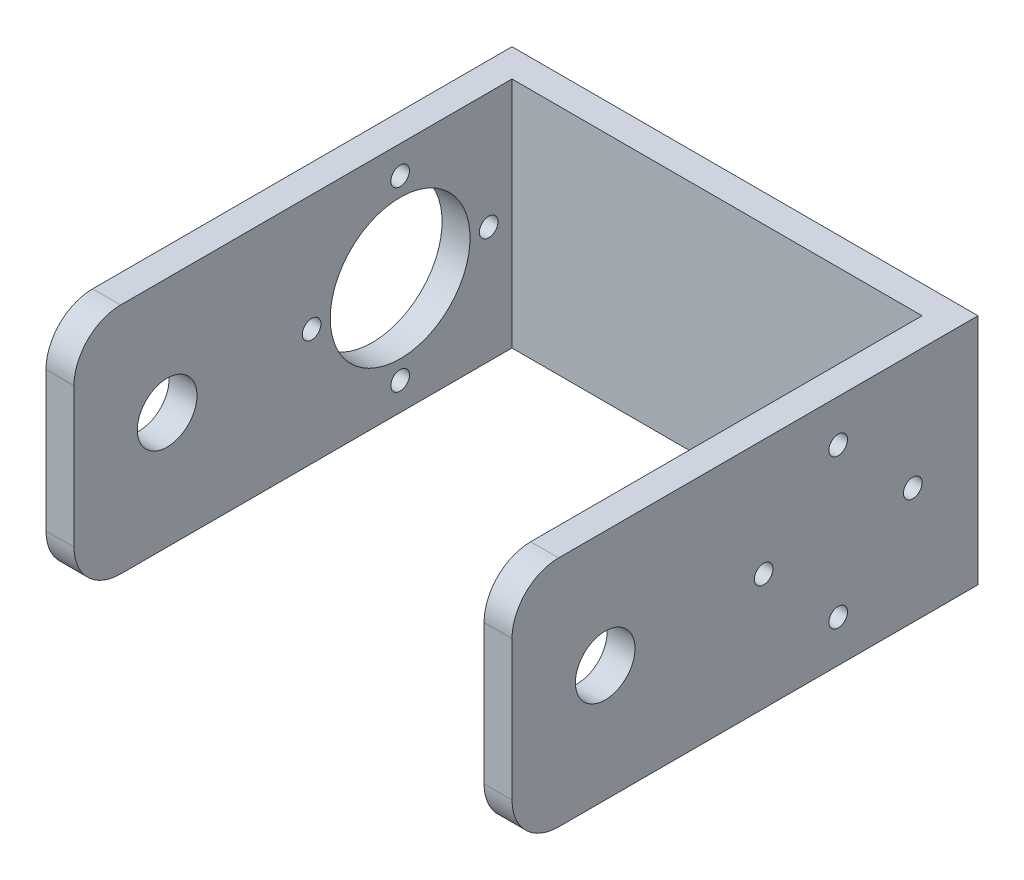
from build123d import *

# Parameters (mm, degrees)
BOSS_EXTRUDE1_DEPTH = 25
CUT_EXTRUDE1_REACH  = 63.237
SKETCH2_R           = 7.5
SKETCH2_R_2         = 1
SKETCH2_R_3         = 3.2
CUT_EXTRUDE2_REACH  = 63.237
SKETCH4_R           = 1
SKETCH4_R_2         = 3.2
FILLET1_R           = 5


with BuildPart() as part:
    # Sketch1 → Boss-Extrude1 (new body)
    with BuildSketch(Plane(origin=(0, 0, 0), x_dir=(1, 0, 0), z_dir=(0, 1, 0))):
        Polygon((-23, 25), (27, 25), (27, -25), (24, -25), (24, 22), (-20, 22), (-20, -25), (-23, -25), align=None)
    extrude(amount=BOSS_EXTRUDE1_DEPTH)

    # Sketch2 → Cut-Extrude1 (cut, up to next)
    with BuildSketch(Plane.ZY.offset(23), mode=Mode.PRIVATE) as cut_extrude1_sk1:
        with Locations((-10, 12.5)):
            Circle(SKETCH2_R)
    cut_extrude1_tool1 = extrude(cut_extrude1_sk1.sketch, amount=-CUT_EXTRUDE1_REACH, mode=Mode.PRIVATE) & part.part
    # Sketch2 → Cut-Extrude1 (cut, up to next)
    with BuildSketch(Plane.ZY.offset(23), mode=Mode.PRIVATE) as cut_extrude1_sk2:
        with Locations((-10, 22)):
            Circle(SKETCH2_R_2)
    cut_extrude1_tool2 = extrude(cut_extrude1_sk2.sketch, amount=-CUT_EXTRUDE1_REACH, mode=Mode.PRIVATE) & part.part
    # Sketch2 → Cut-Extrude1 (cut, up to next)
    with BuildSketch(Plane.ZY.offset(23), mode=Mode.PRIVATE) as cut_extrude1_sk3:
        with Locations((-0.5, 12.5)):
            Circle(SKETCH2_R_2)
    cut_extrude1_tool3 = extrude(cut_extrude1_sk3.sketch, amount=-CUT_EXTRUDE1_REACH, mode=Mode.PRIVATE) & part.part
    # Sketch2 → Cut-Extrude1 (cut, up to next)
    with BuildSketch(Plane.ZY.offset(23), mode=Mode.PRIVATE) as cut_extrude1_sk4:
        with Locations((-10, 3)):
            Circle(SKETCH2_R_2)
    cut_extrude1_tool4 = extrude(cut_extrude1_sk4.sketch, amount=-CUT_EXTRUDE1_REACH, mode=Mode.PRIVATE) & part.part
    # Sketch2 → Cut-Extrude1 (cut, up to next)
    with BuildSketch(Plane.ZY.offset(23), mode=Mode.PRIVATE) as cut_extrude1_sk5:
        with Locations((-19.5, 12.5)):
            Circle(SKETCH2_R_2)
    cut_extrude1_tool5 = extrude(cut_extrude1_sk5.sketch, amount=-CUT_EXTRUDE1_REACH, mode=Mode.PRIVATE) & part.part
    # Sketch2 → Cut-Extrude1 (cut, up to next)
    with BuildSketch(Plane.ZY.offset(23), mode=Mode.PRIVATE) as cut_extrude1_sk6:
        with Locations((15, 12.5)):
            Circle(SKETCH2_R_3)
    cut_extrude1_tool6 = extrude(cut_extrude1_sk6.sketch, amount=-CUT_EXTRUDE1_REACH, mode=Mode.PRIVATE) & part.part
    add(cut_extrude1_tool1.solids().sort_by_distance((-23, 12.5, -10))[0], mode=Mode.SUBTRACT)
    add(cut_extrude1_tool2.solids().sort_by_distance((-23, 22, -10))[0], mode=Mode.SUBTRACT)
    add(cut_extrude1_tool3.solids().sort_by_distance((-23, 12.5, -0.5))[0], mode=Mode.SUBTRACT)
    add(cut_extrude1_tool4.solids().sort_by_distance((-23, 3, -10))[0], mode=Mode.SUBTRACT)
    add(cut_extrude1_tool5.solids().sort_by_distance((-23, 12.5, -19.5))[0], mode=Mode.SUBTRACT)
    add(cut_extrude1_tool6.solids().sort_by_distance((-23, 12.5, 15))[0], mode=Mode.SUBTRACT)

    # Sketch4 → Cut-Extrude2 (cut, up to next)
    with BuildSketch(Plane(origin=(27, 0, 0), x_dir=(0, 0, -1), z_dir=(1, 0, 0)), mode=Mode.PRIVATE) as cut_extrude2_sk1:
        with Locations((10, 20.5)):
            Circle(SKETCH4_R)
    cut_extrude2_tool1 = extrude(cut_extrude2_sk1.sketch, amount=-CUT_EXTRUDE2_REACH, mode=Mode.PRIVATE) & part.part
    # Sketch4 → Cut-Extrude2 (cut, up to next)
    with BuildSketch(Plane(origin=(27, 0, 0), x_dir=(0, 0, -1), z_dir=(1, 0, 0)), mode=Mode.PRIVATE) as cut_extrude2_sk2:
        with Locations((18, 12.5)):
            Circle(SKETCH4_R)
    cut_extrude2_tool2 = extrude(cut_extrude2_sk2.sketch, amount=-CUT_EXTRUDE2_REACH, mode=Mode.PRIVATE) & part.part
    # Sketch4 → Cut-Extrude2 (cut, up to next)
    with BuildSketch(Plane(origin=(27, 0, 0), x_dir=(0, 0, -1), z_dir=(1, 0, 0)), mode=Mode.PRIVATE) as cut_extrude2_sk3:
        with Locations((2, 12.5)):
            Circle(SKETCH4_R)
    cut_extrude2_tool3 = extrude(cut_extrude2_sk3.sketch, amount=-CUT_EXTRUDE2_REACH, mode=Mode.PRIVATE) & part.part
    # Sketch4 → Cut-Extrude2 (cut, up to next)
    with BuildSketch(Plane(origin=(27, 0, 0), x_dir=(0, 0, -1), z_dir=(1, 0, 0)), mode=Mode.PRIVATE) as cut_extrude2_sk4:
        with Locations((10, 4.5)):
            Circle(SKETCH4_R)
    cut_extrude2_tool4 = extrude(cut_extrude2_sk4.sketch, amount=-CUT_EXTRUDE2_REACH, mode=Mode.PRIVATE) & part.part
    # Sketch4 → Cut-Extrude2 (cut, up to next)
    with BuildSketch(Plane(origin=(27, 0, 0), x_dir=(0, 0, -1), z_dir=(1, 0, 0)), mode=Mode.PRIVATE) as cut_extrude2_sk5:
        with Locations(Location((-15, 12.5, 0), (0, 0, 180))):
            Circle(SKETCH4_R_2)
    cut_extrude2_tool5 = extrude(cut_extrude2_sk5.sketch, amount=-CUT_EXTRUDE2_REACH, mode=Mode.PRIVATE) & part.part
    add(cut_extrude2_tool1.solids().sort_by_distance((27, 20.5, -10))[0], mode=Mode.SUBTRACT)
    add(cut_extrude2_tool2.solids().sort_by_distance((27, 12.5, -18))[0], mode=Mode.SUBTRACT)
    add(cut_extrude2_tool3.solids().sort_by_distance((27, 12.5, -2))[0], mode=Mode.SUBTRACT)
    add(cut_extrude2_tool4.solids().sort_by_distance((27, 4.5, -10))[0], mode=Mode.SUBTRACT)
    add(cut_extrude2_tool5.solids().sort_by_distance((27, 12.5, 15))[0], mode=Mode.SUBTRACT)

    # Fillet1
    fillet1_edges = [part.edges().sort_by_distance(p)[0] for p in [
        (-21.5, 0, 25),
        (-21.5, 25, 25),
        (25.5, 25, 25),
        (25.5, 0, 25),
    ]]
    fillet(fillet1_edges, radius=FILLET1_R)


solid = part.part
